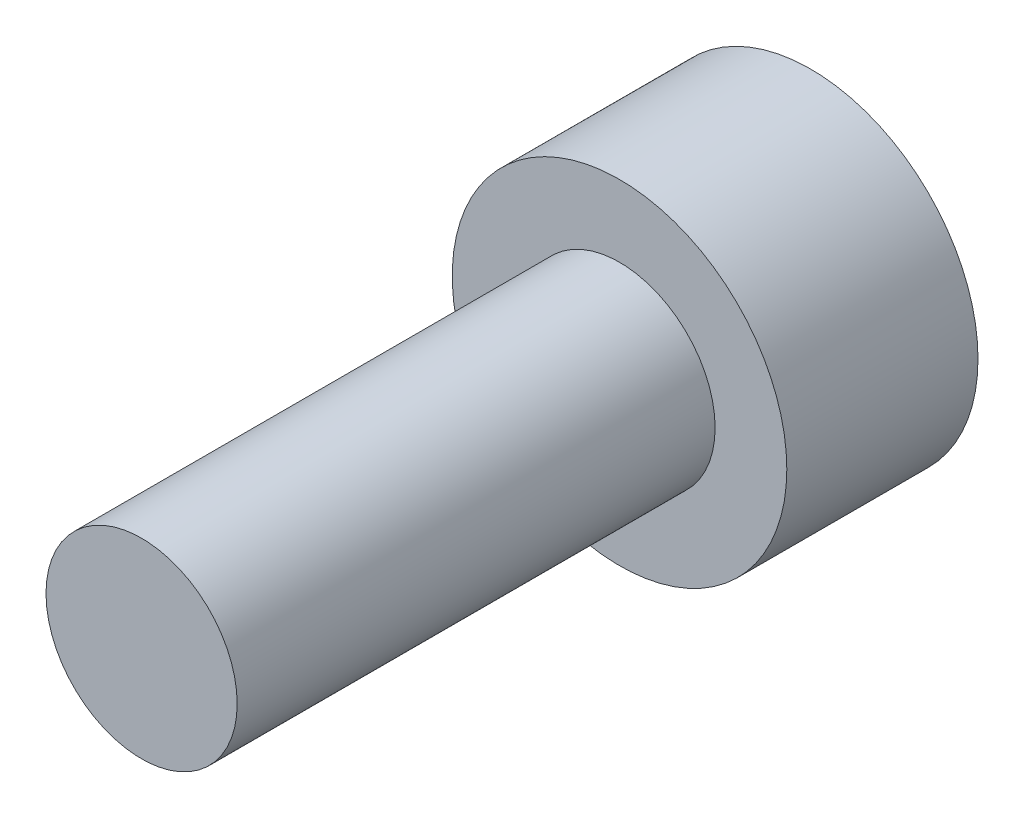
from build123d import *

# Parameters (mm, degrees)
HEX_2_DEPTH = 3


with BuildPart() as part:
    # Sketch6 → Revolve1 (revolve)
    with BuildSketch(Plane(origin=(0, 0, 0), x_dir=(0, 0, -1), z_dir=(1, 0, 0)), mode=Mode.PRIVATE) as revolve1_sk:
        Polygon((-10, 0), (-10, -2), (0, -2), (0, -3.5), (4, -3.5), (4, 0), align=None)
    revolve(revolve1_sk.sketch.rotate(Axis((0, 0, 10), (0, 0, -1)), 270), axis=Axis((0, 0, 10), (0, 0, -1)))

    # Sketch7 → HEX 2 (cut)
    with BuildSketch(Plane(origin=(0, 0, -4), x_dir=(-1, 0, 0), z_dir=(0, 0, -1))):
        Polygon((-1.5, 0.866025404), (-1.5, -0.866025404), (0, -1.732050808), (1.5, -0.866025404), (1.5, 0.866025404), (0, 1.732050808), align=None)
    extrude(amount=-HEX_2_DEPTH, mode=Mode.SUBTRACT)


solid = part.part
